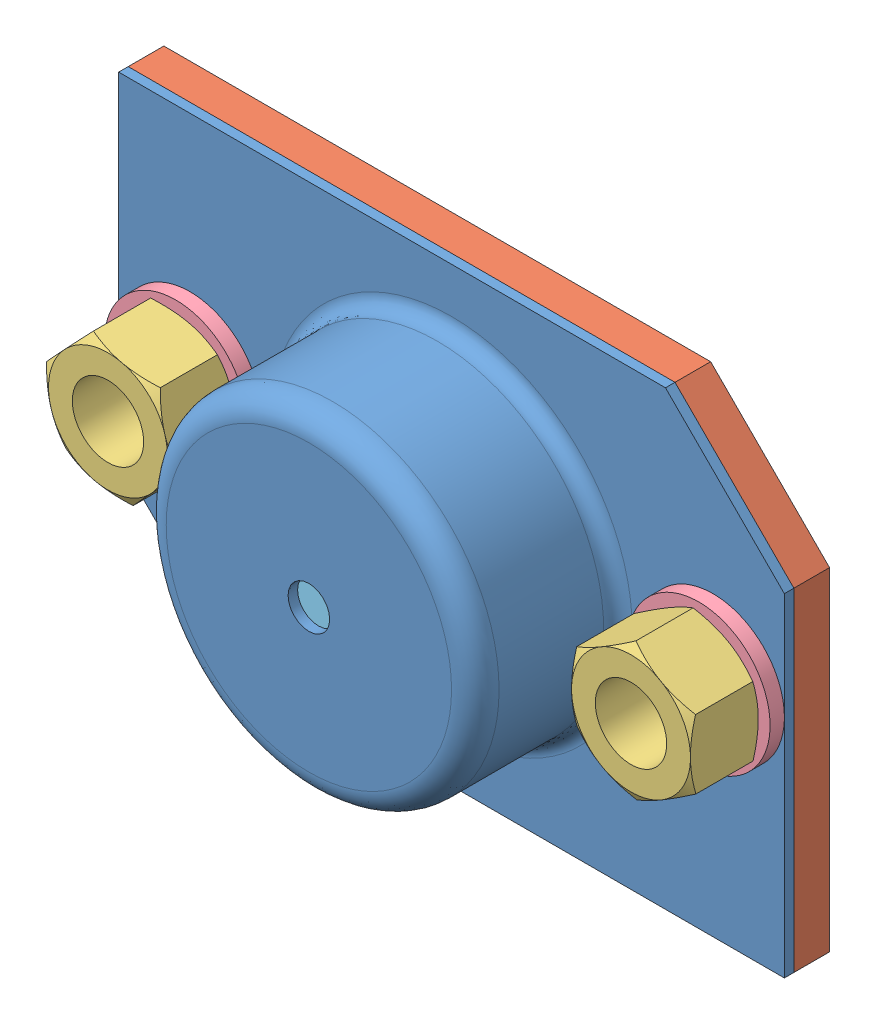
SolidWorks assembly SE Filtre.SLDASM, configuration Défaut (file format 3800). Lengths in mm.
Overall size (59.97 38 19.3).
9 component instances, 6 part files, 17 mates.
Components (placement in the parent):
- porte filtre-1: porte filtre.SLDPRT [Défaut] at (13.3026 3.6052 -0.4) size (56 38 12.8)
- Joint du filtre-1: Joint du filtre.SLDPRT [Défaut] at (13.3026 3.6052 -3.4) size (56 38 3)
- Goujon M6-15-1: Goujon M6-15.SLDPRT [Défaut] at (-30.6974 -17.3948 -6.9) size (6 6 15)
- Goujon M6-15-2: Goujon M6-15.SLDPRT [Défaut] at (13.3026 -17.3948 -6.9) x (0.676874 -0.736099 0) z (0 0 1) size (6 6 15)
- Ecrou ISO 4032 - M6-1: Ecrou ISO 4032 - M6.SLDPRT [Défaut] at (-30.6974 -17.3948 7.3) x (0.957342 0.288956 0) z (0 0 1) size (10 11.55 5.7)
- Ecrou ISO 4032 - M6-2: Ecrou ISO 4032 - M6.SLDPRT [Défaut] at (13.3026 -17.3948 7.3) x (0.495521 0.868596 0) z (0 0 1) size (10 11.55 5.7)
- Rondelle plate ISO 10673 - Type M - 6-1: Rondelle plate ISO 10673 - Type M - 6.SLDPRT [Défaut] at (-30.6974 -17.3948 1.6) x (0 0 -1) z (0.725693 -0.688019 0) size (1.2 12 12)
- Rondelle plate ISO 10673 - Type M - 6-2: Rondelle plate ISO 10673 - Type M - 6.SLDPRT [Défaut] at (13.3026 -17.3948 1.6) x (0 0 -1) z (0.980697 0.195531 0) size (1.2 12 12)
- filtre-1: filtre.SLDPRT [Default] at (-8.6974 -17.3948 -0.4) x (0.999889 -0.014925 0) z (-0.014925 -0.999889 0) size (26.4 12 26.4)
Mates (geometry in assembly coordinates):
- Coïncidente2: coincident aligned: axis of porte filtre-1; axis of Joint du filtre-1
- Coïncidente3: coincident aligned: axis of porte filtre-1; axis of Joint du filtre-1
- Coïncidente4: coincident anti-aligned: plane of porte filtre-1 through (19.3026 1.6052 -0.4) normal (0 0 -1); plane of Joint du filtre-1 through (-36.6974 1.6052 -0.4) normal (0 0 1)
- Coaxial2: concentric aligned: cylinder of Joint du filtre-1; cylinder of Goujon M6-15-1
- Coaxial3: concentric aligned: cylinder of Joint du filtre-1; cylinder of Goujon M6-15-2
- Coaxial4: concentric anti-aligned: cylinder of Goujon M6-15-1; cylinder of Ecrou ISO 4032 - M6-1
- Coaxial5: concentric anti-aligned: cylinder of Goujon M6-15-2; cylinder of Ecrou ISO 4032 - M6-2
- Coaxial6: concentric anti-aligned: cylinder of Goujon M6-15-1; cylinder of Rondelle plate ISO 10673 - Type M - 6-1
- Coaxial7: concentric anti-aligned: cylinder of Goujon M6-15-2; cylinder of Rondelle plate ISO 10673 - Type M - 6-2
- A distance1: distance = 3.5 mm aligned: plane of Joint du filtre-1 through (-36.6974 1.6052 -3.4) normal (0 0 -1); plane of Goujon M6-15-2 through (13.3026 -17.3948 -6.9) normal (0 0 -1)
- A distance2: distance = 3.5 mm aligned: plane of Joint du filtre-1 through (-36.6974 1.6052 -3.4) normal (0 0 -1); plane of Goujon M6-15-1 through (-30.6974 -17.3948 -6.9) normal (0 0 -1)
- Coïncidente9: coincident anti-aligned: plane of porte filtre-1 through (-10.4474 -17.3948 11.6) normal (0 0 -1); plane of filtre-1 through (-20.6961 -17.2157 11.6) normal (0 0 1)
- Coaxiale1: concentric aligned: cylinder of porte filtre-1; cylinder of filtre-1
- Coïncidente10: coincident aligned: plane of porte filtre-1 through (19.3026 1.6052 0.4) normal (0 0 1); circle of Rondelle plate ISO 10673 - Type M - 6-1
- Coïncidente11: coincident anti-aligned: plane of Ecrou ISO 4032 - M6-1 through (-37.9865 -10.5487 1.6) normal (0 0 -1); plane of Rondelle plate ISO 10673 - Type M - 6-1 through (-35.0516 -13.2667 1.6) normal (0 0 1)
- Coïncidente12: coincident aligned: plane of porte filtre-1 through (19.3026 1.6052 0.4) normal (0 0 1); circle of Rondelle plate ISO 10673 - Type M - 6-2
- Coïncidente13: coincident anti-aligned: plane of Ecrou ISO 4032 - M6-2 through (3.3027 -17.4464 1.6) normal (0 0 -1); plane of Rondelle plate ISO 10673 - Type M - 6-2 through (7.4184 -18.568 1.6) normal (0 0 1)
